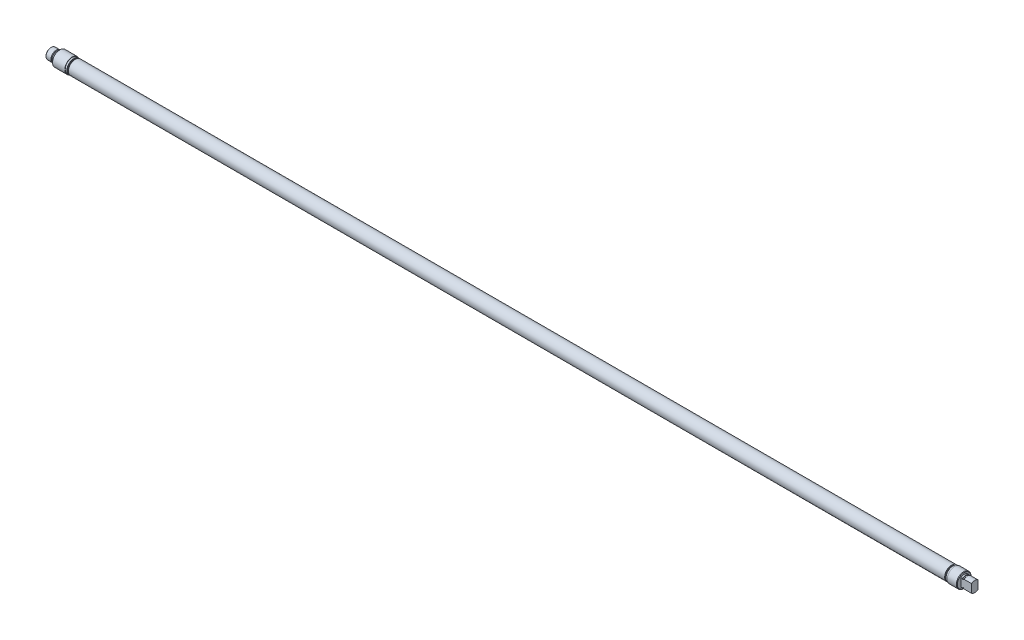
from build123d import *

# Parameters (mm, degrees)
CUT_EXTRUDE1_DEPTH      = 1376.623719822
CUT_EXTRUDE1_DEPTH_BACK = 1376.623719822
SKETCH14_W              = 15.748
SKETCH14_H              = 3.0861
CHAMFER1_SIZE           = 0.762


with BuildPart() as part:
    # Sketch2 → Base-Revolve (revolve)
    with BuildSketch(Plane.XY, mode=Mode.PRIVATE) as base_revolve_sk:
        with BuildLine():
            Line((1345.565, 10.287), (31.75, 10.287))
            Line((31.75, 10.287), (31.75, 10.922))
            Line((31.75, 10.922), (12.7, 10.922))
            Line((12.7, 10.922), (12.7, 7.9121))
            Line((12.7, 7.9121), (10.414, 7.9121))
            Line((10.414, 7.9121), (10.414, 7.62))
            ThreePointArc((10.414, 7.62), (10.265210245, 7.260789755), (9.906, 7.112))
            Line((9.906, 7.112), (9.10042049, 7.112))
            ThreePointArc((9.10042049, 7.112), (8.906017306, 7.150669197), (8.741210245, 7.260789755))
            Line((8.741210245, 7.260789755), (8.0899, 7.9121))
            Line((8.0899, 7.9121), (0, 7.9121))
            Line((0, 7.9121), (0, 0))
            Line((0, 0), (1375.537, 0))
            Line((1375.537, 0), (1375.537, 7.9121))
            Line((1375.537, 7.9121), (1364.3991, 7.9121))
            Line((1364.3991, 7.9121), (1363.599, 7.112))
            Line((1363.599, 7.112), (1362.075, 7.112))
            Line((1362.075, 7.112), (1362.075, 7.9121))
            Line((1362.075, 7.9121), (1359.789, 7.9121))
            Line((1359.789, 7.9121), (1359.789, 10.922))
            Line((1359.789, 10.922), (1345.565, 10.922))
            Line((1345.565, 10.922), (1345.565, 10.287))
        make_face()
    revolve(base_revolve_sk.sketch.rotate(Axis((-21.417447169, 0, 0), (1, 0, 0)), 90), axis=Axis((-21.417447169, 0, 0), (1, 0, 0)))

    # Sketch3 → Cut-Revolve1 (revolve, cut)
    with BuildSketch(Plane.XY, mode=Mode.PRIVATE) as cut_revolve1_sk:
        Polygon((34.29, 10.287), (34.29, 9.398), (35.179, 10.287), align=None)
        Polygon((35.56, 10.287), (35.56, 9.398), (36.449, 10.287), align=None)
    revolve(cut_revolve1_sk.sketch.rotate(Axis((0, 0, 0), (1, 0, 0)), 90), axis=Axis((0, 0, 0), (1, 0, 0)), mode=Mode.SUBTRACT)

    # Sketch6 → Cut-Revolve2 (revolve, cut)
    with BuildSketch(Plane.XY, mode=Mode.PRIVATE) as cut_revolve2_sk:
        Polygon((1327.5945, 0), (1327.5945, 9.525), (44.8945, 9.525), (44.8945, 3.175), (0, 3.175), (0, 0), align=None)
    revolve(cut_revolve2_sk.sketch.rotate(Axis((0, 0, 0), (-1, 0, 0)), 90), axis=Axis((0, 0, 0), (-1, 0, 0)), mode=Mode.SUBTRACT)

    # Sketch13 → Cut-Revolve5 (revolve, cut)
    with BuildSketch(Plane.XY, mode=Mode.PRIVATE) as cut_revolve5_sk:
        Polygon((1340.993, 10.287), (1341.755, 10.287), (1341.755, 9.525), align=None)
        Polygon((1342.263, 10.287), (1343.025, 10.287), (1343.025, 9.525), align=None)
    revolve(cut_revolve5_sk.sketch.rotate(Axis((-4.583082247, 0, 0), (1, 0, 0)), 90), axis=Axis((-4.583082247, 0, 0), (1, 0, 0)), mode=Mode.SUBTRACT)

    # Sketch14 → Cut-Extrude1 (cut, two sides: drawn at the far end of the back side and taken through both)
    with BuildSketch(Plane(origin=(0, 0, 0), x_dir=(1, 0, 0), z_dir=(0, 1, 0)).offset(-CUT_EXTRUDE1_DEPTH_BACK)):
        with Locations((1367.663, 6.36905)):
            Rectangle(SKETCH14_W, SKETCH14_H)
        with Locations((1367.663, -6.36905)):
            Rectangle(SKETCH14_W, SKETCH14_H)
    extrude(amount=CUT_EXTRUDE1_DEPTH + CUT_EXTRUDE1_DEPTH_BACK, mode=Mode.SUBTRACT)

    # Chamfer1
    chamfer1_edges = [part.edges().sort_by_distance(p)[0] for p in [
        (0, 0, -7.9121),
        (1359.789, 0, -10.922),
        (12.7, 0, -10.922),
    ]]
    chamfer(chamfer1_edges, length=CHAMFER1_SIZE)


solid = part.part
